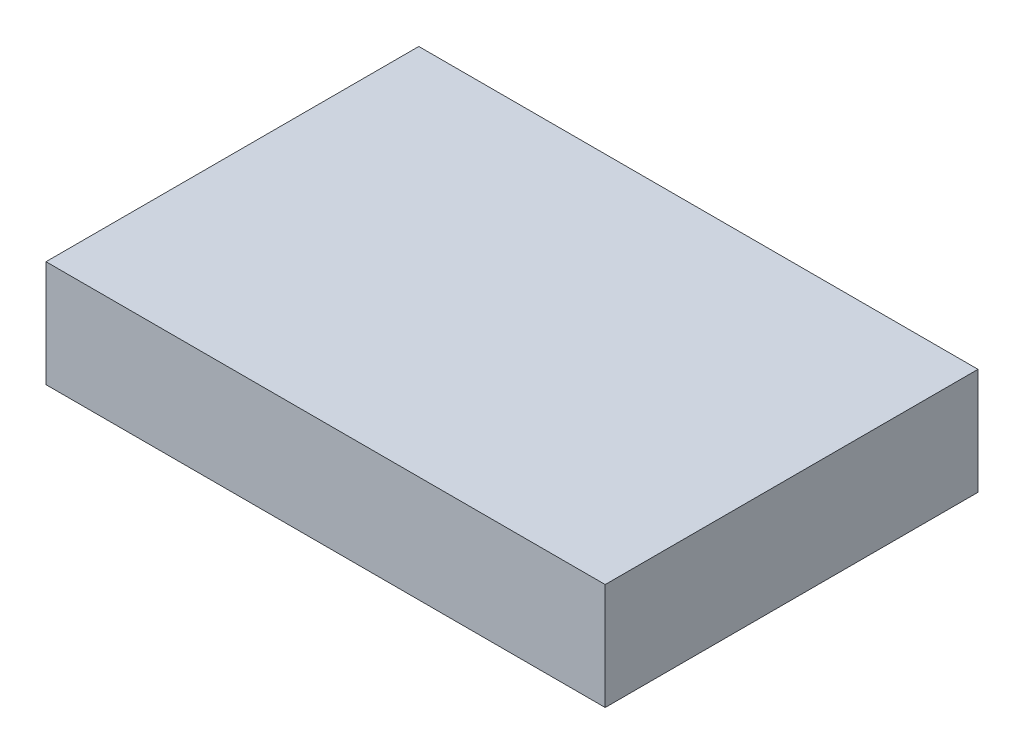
from build123d import *

# Parameters (mm, degrees)
SKETCH_1_W      = 126
SKETCH_1_H      = 84
EXTRUDE_1_DEPTH = 24


with BuildPart() as part:
    # Sketch 1 → Extrude 1 (new body)
    with BuildSketch(Plane(origin=(0, 0, 0), x_dir=(1, 0, 0), z_dir=(0, 1, 0))):
        Rectangle(SKETCH_1_W, SKETCH_1_H)
    extrude(amount=EXTRUDE_1_DEPTH)


solid = part.part
